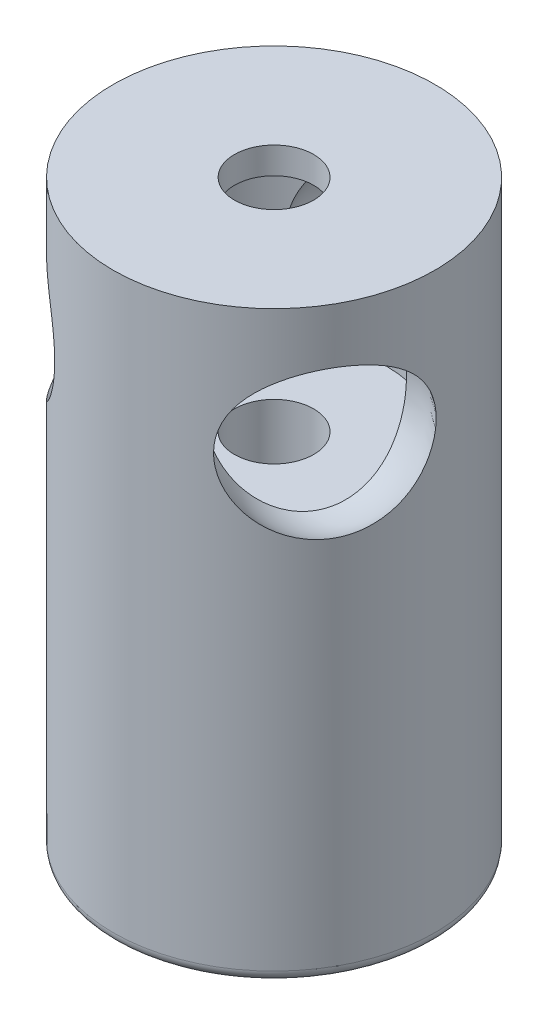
ISO-10303-21;
HEADER;
FILE_DESCRIPTION(('STEP AP214'),'2;1');
FILE_NAME('part.step','',(''),(''),'','','');
FILE_SCHEMA(('AUTOMOTIVE_DESIGN { 1 0 10303 214 1 1 1 1 }'));
ENDSEC;
DATA;
#1=APPLICATION_CONTEXT('core data for automotive mechanical design processes');
#2=APPLICATION_PROTOCOL_DEFINITION('international standard','automotive_design',2000,#1);
#3=PRODUCT_CONTEXT('',#1,'mechanical');
#4=PRODUCT('Part','Part','',(#3));
#5=PRODUCT_RELATED_PRODUCT_CATEGORY('part','',(#4));
#6=PRODUCT_DEFINITION_FORMATION('','',#4);
#7=PRODUCT_DEFINITION_CONTEXT('part definition',#1,'design');
#8=PRODUCT_DEFINITION('design','',#6,#7);
#9=PRODUCT_DEFINITION_SHAPE('','',#8);
#10=(LENGTH_UNIT() NAMED_UNIT(*) SI_UNIT(.MILLI.,.METRE.));
#11=(NAMED_UNIT(*) PLANE_ANGLE_UNIT() SI_UNIT($,.RADIAN.));
#12=(NAMED_UNIT(*) SI_UNIT($,.STERADIAN.) SOLID_ANGLE_UNIT());
#13=UNCERTAINTY_MEASURE_WITH_UNIT(LENGTH_MEASURE(1.E-05),#10,'distance_accuracy_value','');
#14=(GEOMETRIC_REPRESENTATION_CONTEXT(3) GLOBAL_UNCERTAINTY_ASSIGNED_CONTEXT((#13)) GLOBAL_UNIT_ASSIGNED_CONTEXT((#10,
#11,#12)) REPRESENTATION_CONTEXT('',''));
#15=CARTESIAN_POINT('',(0.,0.,0.));
#16=DIRECTION('',(0.,0.,1.));
#17=DIRECTION('',(1.,0.,0.));
#18=AXIS2_PLACEMENT_3D('',#15,#16,#17);
#19=CARTESIAN_POINT('',(0.,12.6227286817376,0.));
#20=DIRECTION('',(0.,1.,0.));
#21=DIRECTION('',(0.,0.,1.));
#22=AXIS2_PLACEMENT_3D('',#19,#20,#21);
#23=CYLINDRICAL_SURFACE('',#22,1.99058744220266);
#24=CARTESIAN_POINT('',(0.,4.34418892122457,0.));
#25=DIRECTION('',(0.,1.,0.));
#26=DIRECTION('',(0.,0.,1.));
#27=AXIS2_PLACEMENT_3D('',#24,#25,#26);
#28=CIRCLE('',#27,1.99058744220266);
#29=CARTESIAN_POINT('',(0.,4.34418892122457,1.99058744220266));
#30=VERTEX_POINT('',#29);
#31=EDGE_CURVE('E10',#30,#30,#28,.T.);
#32=ORIENTED_EDGE('',*,*,#31,.F.);
#33=EDGE_LOOP('',(#32));
#34=FACE_BOUND('',#33,.T.);
#35=CARTESIAN_POINT('',(0.,6.40873465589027,0.));
#36=DIRECTION('',(0.,1.,0.));
#37=DIRECTION('',(0.,0.,1.));
#38=AXIS2_PLACEMENT_3D('',#35,#36,#37);
#39=CIRCLE('',#38,1.99058744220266);
#40=CARTESIAN_POINT('',(0.,6.40873465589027,1.99058744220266));
#41=VERTEX_POINT('',#40);
#42=EDGE_CURVE('E57',#41,#41,#39,.T.);
#43=ORIENTED_EDGE('',*,*,#42,.T.);
#44=EDGE_LOOP('',(#43));
#45=FACE_BOUND('',#44,.T.);
#46=ADVANCED_FACE('F34',(#34,#45),#23,.F.);
#47=CARTESIAN_POINT('',(0.,4.34418892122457,0.));
#48=DIRECTION('',(0.,1.,0.));
#49=DIRECTION('',(0.,0.,1.));
#50=AXIS2_PLACEMENT_3D('',#47,#48,#49);
#51=TOROIDAL_SURFACE('',#50,2.156279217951,0.165691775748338);
#52=CARTESIAN_POINT('',(0.,4.34418892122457,0.));
#53=DIRECTION('',(0.,1.,0.));
#54=DIRECTION('',(0.,0.,1.));
#55=AXIS2_PLACEMENT_3D('',#52,#53,#54);
#56=CIRCLE('',#55,2.32197099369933);
#57=CARTESIAN_POINT('',(0.,4.34418892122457,2.32197099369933));
#58=VERTEX_POINT('',#57);
#59=EDGE_CURVE('E41',#58,#58,#56,.T.);
#60=ORIENTED_EDGE('',*,*,#59,.F.);
#61=EDGE_LOOP('',(#60));
#62=FACE_BOUND('',#61,.T.);
#63=ORIENTED_EDGE('',*,*,#31,.T.);
#64=EDGE_LOOP('',(#63));
#65=FACE_BOUND('',#64,.T.);
#66=ADVANCED_FACE('F130',(#62,#65),#51,.T.);
#67=CARTESIAN_POINT('',(0.,12.6227286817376,0.));
#68=DIRECTION('',(0.,1.,0.));
#69=DIRECTION('',(0.,0.,1.));
#70=AXIS2_PLACEMENT_3D('',#67,#68,#69);
#71=CYLINDRICAL_SURFACE('',#70,2.32197099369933);
#72=CARTESIAN_POINT('',(-2.32190491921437,10.7621571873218,-0.0175168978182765));
#73=CARTESIAN_POINT('',(-2.32190697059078,10.816123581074,-0.0175121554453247));
#74=CARTESIAN_POINT('',(-2.32195797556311,10.8701430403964,-0.0126107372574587));
#75=CARTESIAN_POINT('',(-2.32198024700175,10.9764967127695,0.00669888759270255));
#76=CARTESIAN_POINT('',(-2.3219513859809,11.0288280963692,0.0211222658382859));
#77=CARTESIAN_POINT('',(-2.32130743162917,11.1300520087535,0.0585318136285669));
#78=CARTESIAN_POINT('',(-2.32069484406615,11.1789582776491,0.0814811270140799));
#79=CARTESIAN_POINT('',(-2.31820957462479,11.2724916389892,0.134766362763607));
#80=CARTESIAN_POINT('',(-2.31633689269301,11.3171187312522,0.165102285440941));
#81=CARTESIAN_POINT('',(-2.31045963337,11.4035541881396,0.233587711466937));
#82=CARTESIAN_POINT('',(-2.30635044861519,11.4450998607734,0.272058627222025));
#83=CARTESIAN_POINT('',(-2.29516489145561,11.5221614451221,0.35424302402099));
#84=CARTESIAN_POINT('',(-2.28808740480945,11.5576750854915,0.397958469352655));
#85=CARTESIAN_POINT('',(-2.26929108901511,11.6261169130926,0.494524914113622));
#86=CARTESIAN_POINT('',(-2.2571272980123,11.658260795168,0.547846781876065));
#87=CARTESIAN_POINT('',(-2.22770527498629,11.7143233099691,0.65733950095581));
#88=CARTESIAN_POINT('',(-2.21044526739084,11.7382390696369,0.713511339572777));
#89=CARTESIAN_POINT('',(-2.1694239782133,11.778781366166,0.830170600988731));
#90=CARTESIAN_POINT('',(-2.14534625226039,11.7949103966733,0.890720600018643));
#91=CARTESIAN_POINT('',(-2.09135461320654,11.8176034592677,1.01100571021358));
#92=CARTESIAN_POINT('',(-2.06144036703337,11.8241669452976,1.07074077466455));
#93=CARTESIAN_POINT('',(-1.99617304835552,11.8276840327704,1.18801347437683));
#94=CARTESIAN_POINT('',(-1.96078327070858,11.8245698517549,1.24553274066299));
#95=CARTESIAN_POINT('',(-1.88582899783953,11.808610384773,1.35634566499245));
#96=CARTESIAN_POINT('',(-1.84626440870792,11.795764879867,1.40963922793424));
#97=CARTESIAN_POINT('',(-1.7645213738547,11.7604663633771,1.51070719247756));
#98=CARTESIAN_POINT('',(-1.72234436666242,11.73801859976,1.55848459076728));
#99=CARTESIAN_POINT('',(-1.63726647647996,11.6837109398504,1.6476364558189));
#100=CARTESIAN_POINT('',(-1.59436549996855,11.6518498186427,1.68901008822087));
#101=CARTESIAN_POINT('',(-1.51017210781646,11.5790825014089,1.76468987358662));
#102=CARTESIAN_POINT('',(-1.46887729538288,11.5381904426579,1.79900691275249));
#103=CARTESIAN_POINT('',(-1.39039680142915,11.4478240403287,1.86033029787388));
#104=CARTESIAN_POINT('',(-1.35321073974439,11.3983504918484,1.8873373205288));
#105=CARTESIAN_POINT('',(-1.28743723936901,11.2943280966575,1.93276461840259));
#106=CARTESIAN_POINT('',(-1.25851773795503,11.2401467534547,1.95154081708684));
#107=CARTESIAN_POINT('',(-1.209462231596,11.1261765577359,1.98232141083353));
#108=CARTESIAN_POINT('',(-1.18931555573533,11.0663946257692,1.99433403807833));
#109=CARTESIAN_POINT('',(-1.16163053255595,10.9507337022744,2.01056965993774));
#110=CARTESIAN_POINT('',(-1.15286279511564,10.8952560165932,2.01555853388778));
#111=CARTESIAN_POINT('',(-1.14448346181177,10.7834010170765,2.02033013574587));
#112=CARTESIAN_POINT('',(-1.14486641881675,10.7270242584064,2.02011596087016));
#113=CARTESIAN_POINT('',(-1.15427235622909,10.6205828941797,2.01475200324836));
#114=CARTESIAN_POINT('',(-1.16248616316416,10.5704199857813,2.010064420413));
#115=CARTESIAN_POINT('',(-1.18577141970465,10.4723282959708,1.99641576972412));
#116=CARTESIAN_POINT('',(-1.2008434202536,10.4243996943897,1.98745435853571));
#117=CARTESIAN_POINT('',(-1.23731691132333,10.3306310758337,1.96495902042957));
#118=CARTESIAN_POINT('',(-1.25887656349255,10.2848809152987,1.95130946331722));
#119=CARTESIAN_POINT('',(-1.30685121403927,10.197706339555,1.91950933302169));
#120=CARTESIAN_POINT('',(-1.33326800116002,10.1562835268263,1.90135710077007));
#121=CARTESIAN_POINT('',(-1.39273261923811,10.0739890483,1.85831467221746));
#122=CARTESIAN_POINT('',(-1.42619096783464,10.0336883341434,1.83290038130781));
#123=CARTESIAN_POINT('',(-1.49565974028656,9.95958005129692,1.77666823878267));
#124=CARTESIAN_POINT('',(-1.53167136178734,9.92577555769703,1.7458478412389));
#125=CARTESIAN_POINT('',(-1.60851343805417,9.86172228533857,1.6754769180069));
#126=CARTESIAN_POINT('',(-1.64944906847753,9.83223401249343,1.63534652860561));
#127=CARTESIAN_POINT('',(-1.73052206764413,9.78183948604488,1.5493029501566));
#128=CARTESIAN_POINT('',(-1.77065923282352,9.7609353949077,1.50338830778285));
#129=CARTESIAN_POINT('',(-1.85023643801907,9.72713867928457,1.40441483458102));
#130=CARTESIAN_POINT('',(-1.88956429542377,9.71464783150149,1.35112781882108));
#131=CARTESIAN_POINT('',(-1.96403016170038,9.69933966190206,1.24039816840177));
#132=CARTESIAN_POINT('',(-1.99916797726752,9.69652278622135,1.18295534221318));
#133=CARTESIAN_POINT('',(-2.06425208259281,9.70059229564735,1.0653361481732));
#134=CARTESIAN_POINT('',(-2.09418495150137,9.70750335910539,1.00515320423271));
#135=CARTESIAN_POINT('',(-2.14812472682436,9.73101228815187,0.884028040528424));
#136=CARTESIAN_POINT('',(-2.17213146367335,9.74761043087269,0.823085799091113));
#137=CARTESIAN_POINT('',(-2.21409452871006,9.79035960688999,0.70243664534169));
#138=CARTESIAN_POINT('',(-2.23204730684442,9.81651622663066,0.642730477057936));
#139=CARTESIAN_POINT('',(-2.26222546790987,9.87814995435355,0.52676061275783));
#140=CARTESIAN_POINT('',(-2.27445016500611,9.91362817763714,0.47049732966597));
#141=CARTESIAN_POINT('',(-2.2938869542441,9.99328664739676,0.36406436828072));
#142=CARTESIAN_POINT('',(-2.30112922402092,10.0374123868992,0.313859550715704));
#143=CARTESIAN_POINT('',(-2.31184455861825,10.1339122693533,0.221556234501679));
#144=CARTESIAN_POINT('',(-2.31531760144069,10.1862864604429,0.179457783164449));
#145=CARTESIAN_POINT('',(-2.31970446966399,10.2945868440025,0.108243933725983));
#146=CARTESIAN_POINT('',(-2.32076742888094,10.3500732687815,0.078471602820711));
#147=CARTESIAN_POINT('',(-2.32190132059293,10.4657019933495,0.0302665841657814));
#148=CARTESIAN_POINT('',(-2.32197516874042,10.5258300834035,0.0118007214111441));
#149=CARTESIAN_POINT('',(-2.32196899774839,10.6159398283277,-0.00602551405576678));
#150=CARTESIAN_POINT('',(-2.32194978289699,10.6450097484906,-0.0103247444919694));
#151=CARTESIAN_POINT('',(-2.32191718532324,10.7034335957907,-0.0160717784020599));
#152=CARTESIAN_POINT('',(-2.3219038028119,10.7327875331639,-0.0175194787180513));
#153=CARTESIAN_POINT('',(-2.32190491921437,10.7621571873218,-0.0175168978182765));
#154=B_SPLINE_CURVE_WITH_KNOTS('',3,(#72,#73,#74,#75,#76,#77,#78,#79,#80,#81,#82,#83,#84,#85,
#86,#87,#88,#89,#90,#91,#92,#93,#94,#95,#96,#97,#98,#99,#100,#101,#102,#103,#104,#105,#106,#107,
#108,#109,#110,#111,#112,#113,#114,#115,#116,#117,#118,#119,#120,#121,#122,#123,#124,#125,#126,
#127,#128,#129,#130,#131,#132,#133,#134,#135,#136,#137,#138,#139,#140,#141,#142,#143,#144,#145,
#146,#147,#148,#149,#150,#151,#152,#153),.UNSPECIFIED.,.T.,.F.,(4,2,2,2,2,2,2,2,2,2,2,2,2,2,2,2,
2,2,2,2,2,2,2,2,2,2,2,2,2,2,2,2,2,2,2,2,2,2,2,2,4),(0.,0.16177619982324,0.323810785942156,
0.48515292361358,0.646495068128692,0.816128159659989,0.98582498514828,1.17530867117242,
1.36485845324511,1.56529421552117,1.76574141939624,1.96759571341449,2.16945454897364,
2.37120320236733,2.57297811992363,2.77443938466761,2.97588199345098,3.16745334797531,
3.35879102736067,3.52700776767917,3.6951243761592,3.84756099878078,4.00000986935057,
4.15652661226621,4.31310111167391,4.48704580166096,4.66107262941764,4.85360746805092,
5.0461907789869,5.24741950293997,5.44865750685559,5.65040694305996,5.85216215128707,
6.05403546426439,6.2559329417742,6.45659653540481,6.65726130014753,6.84512435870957,
7.03243352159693,7.12047237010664,7.20851440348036),.UNSPECIFIED.);
#155=CARTESIAN_POINT('',(-2.32190491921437,10.7621571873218,-0.0175168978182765));
#156=VERTEX_POINT('',#155);
#157=EDGE_CURVE('E58',#156,#156,#154,.T.);
#158=ORIENTED_EDGE('',*,*,#157,.T.);
#159=EDGE_LOOP('',(#158));
#160=FACE_BOUND('',#159,.T.);
#161=CARTESIAN_POINT('',(1.14578238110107,10.7621571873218,2.01958709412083));
#162=CARTESIAN_POINT('',(1.14578751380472,10.816123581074,2.01958649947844));
#163=CARTESIAN_POINT('',(1.15005776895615,10.8701430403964,2.01717996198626));
#164=CARTESIAN_POINT('',(1.16679153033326,10.9764967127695,2.00754443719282));
#165=CARTESIAN_POINT('',(1.1792681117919,11.0288280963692,2.0003077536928));
#166=CARTESIAN_POINT('',(1.21134375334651,11.1300520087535,1.98104529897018));
#167=CARTESIAN_POINT('',(1.23091214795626,11.1789582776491,1.9690401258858));
#168=CARTESIAN_POINT('',(1.27581588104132,11.2724916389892,1.94024520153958));
#169=CARTESIAN_POINT('',(1.30115121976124,11.3171187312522,1.92345545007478));
#170=CARTESIAN_POINT('',(1.35752270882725,11.4035541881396,1.88412288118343));
#171=CARTESIAN_POINT('',(1.3887849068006,11.4450998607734,1.86132876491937));
#172=CARTESIAN_POINT('',(1.45436590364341,11.5221614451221,1.81054958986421));
#173=CARTESIAN_POINT('',(1.4886858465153,11.5576750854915,1.78256258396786));
#174=CARTESIAN_POINT('',(1.56291668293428,11.6261169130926,1.71800127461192));
#175=CARTESIAN_POINT('',(1.60301287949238,11.658260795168,1.68080618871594));
#176=CARTESIAN_POINT('',(1.68312534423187,11.7143233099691,1.60057960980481));
#177=CARTESIAN_POINT('',(1.72314157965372,11.7382390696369,1.55754608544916));
#178=CARTESIAN_POINT('',(1.80366081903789,11.778781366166,1.46369097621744));
#179=CARTESIAN_POINT('',(1.84405979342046,11.7949103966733,1.4125640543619));
#180=CARTESIAN_POINT('',(1.92123393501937,11.8176034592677,1.30566336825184));
#181=CARTESIAN_POINT('',(1.95800889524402,11.8241669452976,1.24988933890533));
#182=CARTESIAN_POINT('',(2.02693637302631,11.8276840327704,1.13472983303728));
#183=CARTESIAN_POINT('',(2.0590546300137,11.8245698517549,1.07532175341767));
#184=CARTESIAN_POINT('',(2.11754430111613,11.808610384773,0.955002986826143));
#185=CARTESIAN_POINT('',(2.1439155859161,11.795764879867,0.89409226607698));
#186=CARTESIAN_POINT('',(2.19057149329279,11.7604663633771,0.772766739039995));
#187=CARTESIAN_POINT('',(2.21085943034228,11.73801859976,0.712351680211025));
#188=CARTESIAN_POINT('',(2.24552826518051,11.6837109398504,0.594096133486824));
#189=CARTESIAN_POINT('',(2.25990839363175,11.6518498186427,0.536255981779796));
#190=CARTESIAN_POINT('',(2.2833523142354,11.5790825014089,0.425502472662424));
#191=CARTESIAN_POINT('',(2.29242433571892,11.5381904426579,0.372581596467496));
#192=CARTESIAN_POINT('',(2.30629169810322,11.4478240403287,0.273953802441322));
#193=CARTESIAN_POINT('',(2.31108743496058,11.3983504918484,0.228246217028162));
#194=CARTESIAN_POINT('',(2.31754187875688,11.2943280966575,0.148571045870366));
#195=CARTESIAN_POINT('',(2.31934279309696,11.2401467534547,0.114137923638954));
#196=CARTESIAN_POINT('',(2.32147181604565,11.1261765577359,0.0562643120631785));
#197=CARTESIAN_POINT('',(2.3218017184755,11.0663946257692,0.0328104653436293));
#198=CARTESIAN_POINT('',(2.3220196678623,10.9507337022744,0.000716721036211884));
#199=CARTESIAN_POINT('',(2.32195629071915,10.8952560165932,-0.00937079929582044));
#200=CARTESIAN_POINT('',(2.32189895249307,10.7834010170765,-0.0190133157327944));
#201=CARTESIAN_POINT('',(2.32190495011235,10.7270242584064,-0.0185745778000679));
#202=CARTESIAN_POINT('',(2.32196259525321,10.6205828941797,-0.00774681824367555));
#203=CARTESIAN_POINT('',(2.32200993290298,10.5704199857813,0.00171033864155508));
#204=CARTESIAN_POINT('',(2.32183248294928,10.4723282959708,0.0287002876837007));
#205=CARTESIAN_POINT('',(2.32160767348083,10.4243996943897,0.0462337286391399));
#206=CARTESIAN_POINT('',(2.32036288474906,10.3306310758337,0.0890683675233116));
#207=CARTESIAN_POINT('',(2.31932184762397,10.2848809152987,0.114564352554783));
#208=CARTESIAN_POINT('',(2.31576945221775,10.197706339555,0.172011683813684));
#209=CARTESIAN_POINT('',(2.31325755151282,10.1562835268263,0.203965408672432));
#210=CARTESIAN_POINT('',(2.30571402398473,10.0739890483,0.276984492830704));
#211=CARTESIAN_POINT('',(2.30043377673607,10.0336883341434,0.318667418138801));
#212=CARTESIAN_POINT('',(2.28646969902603,9.95958005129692,0.406945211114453));
#213=CARTESIAN_POINT('',(2.27778426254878,9.92577555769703,0.45354238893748));
#214=CARTESIAN_POINT('',(2.25526229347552,9.86172228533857,0.555275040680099));
#215=CARTESIAN_POINT('',(2.24097617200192,9.83223401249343,0.610791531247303));
#216=CARTESIAN_POINT('',(2.20699674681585,9.78183948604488,0.72402459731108));
#217=CARTESIAN_POINT('',(2.18730208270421,9.7609353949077,0.781741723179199));
#218=CARTESIAN_POINT('',(2.14137714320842,9.72713867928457,0.900144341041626));
#219=CARTESIAN_POINT('',(2.1148931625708,9.71464783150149,0.960846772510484));
#220=CARTESIAN_POINT('',(2.05623140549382,9.69933966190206,1.08070092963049));
#221=CARTESIAN_POINT('',(2.02405336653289,9.69652278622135,1.13985258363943));
#222=CARTESIAN_POINT('',(1.95473420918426,9.70059229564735,1.2550266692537));
#223=CARTESIAN_POINT('',(1.91758068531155,9.70750335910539,1.31104076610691));
#224=CARTESIAN_POINT('',(1.83965310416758,9.73101228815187,1.41831656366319));
#225=CARTESIAN_POINT('',(1.7988789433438,9.74761043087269,1.46957812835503));
#226=CARTESIAN_POINT('',(1.71537524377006,9.79035960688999,1.56624378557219));
#227=CARTESIAN_POINT('',(1.67264457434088,9.81651622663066,1.61164443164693));
#228=CARTESIAN_POINT('',(1.58730080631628,9.87814995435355,1.69576441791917));
#229=CARTESIAN_POINT('',(1.54468772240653,9.91362817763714,1.734482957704));
#230=CARTESIAN_POINT('',(1.4622324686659,9.99328664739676,1.80453219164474));
#231=CARTESIAN_POINT('',(1.42237495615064,10.0374123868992,1.83590659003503));
#232=CARTESIAN_POINT('',(1.34779560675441,10.1339122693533,1.89133800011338));
#233=CARTESIAN_POINT('',(1.31307379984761,10.1862864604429,1.91539496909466));
#234=CARTESIAN_POINT('',(1.25359423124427,10.2945868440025,1.95480103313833));
#235=CARTESIAN_POINT('',(1.2283421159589,10.3500732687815,1.97060774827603));
#236=CARTESIAN_POINT('',(1.18716229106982,10.4657019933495,1.99569223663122));
#237=CARTESIAN_POINT('',(1.17120730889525,10.5258300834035,2.00498912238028));
#238=CARTESIAN_POINT('',(1.15576625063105,10.6159398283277,2.01389689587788));
#239=CARTESIAN_POINT('',(1.15203340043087,10.6450097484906,2.01602987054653));
#240=CARTESIAN_POINT('',(1.14704002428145,10.7034335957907,2.01887515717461));
#241=CARTESIAN_POINT('',(1.14577958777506,10.7327875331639,2.01958741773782));
#242=CARTESIAN_POINT('',(1.14578238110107,10.7621571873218,2.01958709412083));
#243=B_SPLINE_CURVE_WITH_KNOTS('',3,(#161,#162,#163,#164,#165,#166,#167,#168,#169,#170,#171,
#172,#173,#174,#175,#176,#177,#178,#179,#180,#181,#182,#183,#184,#185,#186,#187,#188,#189,#190,
#191,#192,#193,#194,#195,#196,#197,#198,#199,#200,#201,#202,#203,#204,#205,#206,#207,#208,#209,
#210,#211,#212,#213,#214,#215,#216,#217,#218,#219,#220,#221,#222,#223,#224,#225,#226,#227,#228,
#229,#230,#231,#232,#233,#234,#235,#236,#237,#238,#239,#240,#241,#242),.UNSPECIFIED.,.T.,.F.,(4,
2,2,2,2,2,2,2,2,2,2,2,2,2,2,2,2,2,2,2,2,2,2,2,2,2,2,2,2,2,2,2,2,2,2,2,2,2,2,2,4),(0.,
0.16177619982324,0.323810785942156,0.485152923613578,0.646495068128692,0.816128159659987,
0.98582498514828,1.17530867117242,1.36485845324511,1.56529421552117,1.76574141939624,
1.96759571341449,2.16945454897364,2.37120320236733,2.57297811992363,2.77443938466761,
2.97588199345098,3.16745334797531,3.35879102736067,3.52700776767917,3.6951243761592,
3.84756099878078,4.00000986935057,4.15652661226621,4.31310111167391,4.48704580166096,
4.66107262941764,4.85360746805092,5.0461907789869,5.24741950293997,5.44865750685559,
5.65040694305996,5.85216215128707,6.05403546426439,6.2559329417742,6.45659653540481,
6.65726130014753,6.84512435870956,7.03243352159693,7.12047237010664,7.20851440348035),.UNSPECIFIED.);
#244=CARTESIAN_POINT('',(1.14578238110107,10.7621571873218,2.01958709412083));
#245=VERTEX_POINT('',#244);
#246=EDGE_CURVE('E87',#245,#245,#243,.T.);
#247=ORIENTED_EDGE('',*,*,#246,.T.);
#248=EDGE_LOOP('',(#247));
#249=FACE_BOUND('',#248,.T.);
#250=CARTESIAN_POINT('',(1.17612253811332,10.7621571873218,-2.00207019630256));
#251=CARTESIAN_POINT('',(1.17611945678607,10.816123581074,-2.00207434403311));
#252=CARTESIAN_POINT('',(1.17190020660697,10.8701430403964,-2.00456922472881));
#253=CARTESIAN_POINT('',(1.15518871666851,10.9764967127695,-2.01424332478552));
#254=CARTESIAN_POINT('',(1.14268327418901,11.0288280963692,-2.02143001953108));
#255=CARTESIAN_POINT('',(1.10996367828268,11.1300520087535,-2.03957711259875));
#256=CARTESIAN_POINT('',(1.0897826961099,11.1789582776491,-2.05052125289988));
#257=CARTESIAN_POINT('',(1.04239369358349,11.2724916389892,-2.07501156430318));
#258=CARTESIAN_POINT('',(1.01518567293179,11.3171187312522,-2.08855773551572));
#259=CARTESIAN_POINT('',(0.952936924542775,11.4035541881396,-2.11771059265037));
#260=CARTESIAN_POINT('',(0.91756554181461,11.4450998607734,-2.1333873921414));
#261=CARTESIAN_POINT('',(0.840798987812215,11.5221614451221,-2.1647926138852));
#262=CARTESIAN_POINT('',(0.799401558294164,11.5576750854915,-2.18052105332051));
#263=CARTESIAN_POINT('',(0.706374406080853,11.6261169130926,-2.21252618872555));
#264=CARTESIAN_POINT('',(0.654114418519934,11.658260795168,-2.22865297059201));
#265=CARTESIAN_POINT('',(0.544579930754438,11.7143233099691,-2.25791911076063));
#266=CARTESIAN_POINT('',(0.487303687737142,11.7382390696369,-2.27105742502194));
#267=CARTESIAN_POINT('',(0.365763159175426,11.778781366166,-2.29386157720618));
#268=CARTESIAN_POINT('',(0.301286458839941,11.7949103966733,-2.30328465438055));
#269=CARTESIAN_POINT('',(0.17012067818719,11.8176034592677,-2.31666907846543));
#270=CARTESIAN_POINT('',(0.103431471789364,11.8241669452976,-2.32063011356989));
#271=CARTESIAN_POINT('',(-0.0307633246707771,11.8276840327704,-2.32274330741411));
#272=CARTESIAN_POINT('',(-0.0982713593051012,11.8245698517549,-2.32085449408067));
#273=CARTESIAN_POINT('',(-0.231715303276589,11.808610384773,-2.31134865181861));
#274=CARTESIAN_POINT('',(-0.297651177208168,11.795764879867,-2.30373149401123));
#275=CARTESIAN_POINT('',(-0.426050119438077,11.7604663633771,-2.28347393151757));
#276=CARTESIAN_POINT('',(-0.488515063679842,11.73801859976,-2.27083627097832));
#277=CARTESIAN_POINT('',(-0.608261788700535,11.6837109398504,-2.24173258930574));
#278=CARTESIAN_POINT('',(-0.665542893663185,11.6518498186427,-2.22526607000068));
#279=CARTESIAN_POINT('',(-0.773180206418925,11.5790825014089,-2.19019234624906));
#280=CARTESIAN_POINT('',(-0.823547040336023,11.5381904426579,-2.17158850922));
#281=CARTESIAN_POINT('',(-0.915894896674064,11.4478240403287,-2.13428410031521));
#282=CARTESIAN_POINT('',(-0.957876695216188,11.3983504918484,-2.11558353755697));
#283=CARTESIAN_POINT('',(-1.03010463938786,11.2943280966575,-2.08133566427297));
#284=CARTESIAN_POINT('',(-1.06082505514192,11.2401467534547,-2.06567874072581));
#285=CARTESIAN_POINT('',(-1.11200958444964,11.1261765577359,-2.03858572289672));
#286=CARTESIAN_POINT('',(-1.13248616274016,11.0663946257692,-2.02714450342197));
#287=CARTESIAN_POINT('',(-1.16038913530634,10.9507337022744,-2.01128638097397));
#288=CARTESIAN_POINT('',(-1.1690934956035,10.8952560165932,-2.00618773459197));
#289=CARTESIAN_POINT('',(-1.17741549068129,10.7834010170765,-2.00131682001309));
#290=CARTESIAN_POINT('',(-1.17703853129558,10.7270242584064,-2.00154138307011));
#291=CARTESIAN_POINT('',(-1.16769023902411,10.6205828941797,-2.0070051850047));
#292=CARTESIAN_POINT('',(-1.15952376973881,10.5704199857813,-2.01177475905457));
#293=CARTESIAN_POINT('',(-1.13606106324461,10.4723282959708,-2.02511605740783));
#294=CARTESIAN_POINT('',(-1.12076425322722,10.4243996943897,-2.03368808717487));
#295=CARTESIAN_POINT('',(-1.08304597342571,10.3306310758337,-2.05402738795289));
#296=CARTESIAN_POINT('',(-1.06044528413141,10.2848809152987,-2.06587381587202));
#297=CARTESIAN_POINT('',(-1.00891823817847,10.197706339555,-2.09152101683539));
#298=CARTESIAN_POINT('',(-0.979989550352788,10.1562835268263,-2.10532250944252));
#299=CARTESIAN_POINT('',(-0.912981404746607,10.0739890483,-2.13529916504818));
#300=CARTESIAN_POINT('',(-0.874242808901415,10.0336883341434,-2.15156779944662));
#301=CARTESIAN_POINT('',(-0.790809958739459,9.95958005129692,-2.18361344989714));
#302=CARTESIAN_POINT('',(-0.74611290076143,9.92577555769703,-2.19939023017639));
#303=CARTESIAN_POINT('',(-0.646748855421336,9.86172228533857,-2.23075195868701));
#304=CARTESIAN_POINT('',(-0.591527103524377,9.83223401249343,-2.24613805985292));
#305=CARTESIAN_POINT('',(-0.476474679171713,9.78183948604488,-2.27332754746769));
#306=CARTESIAN_POINT('',(-0.416642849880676,9.7609353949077,-2.28513003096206));
#307=CARTESIAN_POINT('',(-0.291140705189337,9.72713867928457,-2.30455917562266));
#308=CARTESIAN_POINT('',(-0.225328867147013,9.71464783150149,-2.31197459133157));
#309=CARTESIAN_POINT('',(-0.0922012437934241,9.69933966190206,-2.32109909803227));
#310=CARTESIAN_POINT('',(-0.0248853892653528,9.69652278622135,-2.32280792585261));
#311=CARTESIAN_POINT('',(0.109517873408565,9.70059229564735,-2.32036281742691));
#312=CARTESIAN_POINT('',(0.176604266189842,9.70750335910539,-2.31619397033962));
#313=CARTESIAN_POINT('',(0.308471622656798,9.73101228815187,-2.30234460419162));
#314=CARTESIAN_POINT('',(0.373252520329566,9.74761043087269,-2.29266392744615));
#315=CARTESIAN_POINT('',(0.498719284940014,9.79035960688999,-2.26868043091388));
#316=CARTESIAN_POINT('',(0.559402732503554,9.81651622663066,-2.25437490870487));
#317=CARTESIAN_POINT('',(0.674924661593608,9.87814995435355,-2.222525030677));
#318=CARTESIAN_POINT('',(0.729762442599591,9.91362817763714,-2.20498028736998));
#319=CARTESIAN_POINT('',(0.831654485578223,9.99328664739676,-2.16859655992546));
#320=CARTESIAN_POINT('',(0.878754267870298,10.0374123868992,-2.14976614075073));
#321=CARTESIAN_POINT('',(0.964048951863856,10.1339122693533,-2.11289423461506));
#322=CARTESIAN_POINT('',(1.0022438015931,10.1862864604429,-2.09485275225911));
#323=CARTESIAN_POINT('',(1.06611023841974,10.2945868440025,-2.06304496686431));
#324=CARTESIAN_POINT('',(1.09242531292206,10.3500732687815,-2.04907935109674));
#325=CARTESIAN_POINT('',(1.13473902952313,10.4657019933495,-2.025958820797));
#326=CARTESIAN_POINT('',(1.15076785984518,10.5258300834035,-2.01678984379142));
#327=CARTESIAN_POINT('',(1.16620274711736,10.6159398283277,-2.00787138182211));
#328=CARTESIAN_POINT('',(1.16991638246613,10.6450097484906,-2.00570512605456));
#329=CARTESIAN_POINT('',(1.17487716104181,10.7034335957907,-2.00280337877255));
#330=CARTESIAN_POINT('',(1.17612421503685,10.7327875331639,-2.00206793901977));
#331=CARTESIAN_POINT('',(1.17612253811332,10.7621571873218,-2.00207019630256));
#332=B_SPLINE_CURVE_WITH_KNOTS('',3,(#250,#251,#252,#253,#254,#255,#256,#257,#258,#259,#260,
#261,#262,#263,#264,#265,#266,#267,#268,#269,#270,#271,#272,#273,#274,#275,#276,#277,#278,#279,
#280,#281,#282,#283,#284,#285,#286,#287,#288,#289,#290,#291,#292,#293,#294,#295,#296,#297,#298,
#299,#300,#301,#302,#303,#304,#305,#306,#307,#308,#309,#310,#311,#312,#313,#314,#315,#316,#317,
#318,#319,#320,#321,#322,#323,#324,#325,#326,#327,#328,#329,#330,#331),.UNSPECIFIED.,.T.,.F.,(4,
2,2,2,2,2,2,2,2,2,2,2,2,2,2,2,2,2,2,2,2,2,2,2,2,2,2,2,2,2,2,2,2,2,2,2,2,2,2,2,4),(0.,
0.16177619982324,0.323810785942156,0.48515292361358,0.646495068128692,0.816128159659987,
0.985824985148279,1.17530867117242,1.36485845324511,1.56529421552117,1.76574141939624,
1.96759571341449,2.16945454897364,2.37120320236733,2.57297811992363,2.77443938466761,
2.97588199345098,3.16745334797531,3.35879102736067,3.52700776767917,3.6951243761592,
3.84756099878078,4.00000986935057,4.15652661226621,4.31310111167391,4.48704580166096,
4.66107262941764,4.85360746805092,5.0461907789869,5.24741950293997,5.44865750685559,
5.65040694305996,5.85216215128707,6.05403546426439,6.2559329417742,6.4565965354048,
6.65726130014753,6.84512435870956,7.03243352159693,7.12047237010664,7.20851440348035),.UNSPECIFIED.);
#333=CARTESIAN_POINT('',(1.17612253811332,10.7621571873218,-2.00207019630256));
#334=VERTEX_POINT('',#333);
#335=EDGE_CURVE('E50',#334,#334,#332,.T.);
#336=ORIENTED_EDGE('',*,*,#335,.T.);
#337=EDGE_LOOP('',(#336));
#338=FACE_BOUND('',#337,.T.);
#339=CARTESIAN_POINT('',(0.,12.6227286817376,0.));
#340=DIRECTION('',(0.,1.,0.));
#341=DIRECTION('',(0.,0.,1.));
#342=AXIS2_PLACEMENT_3D('',#339,#340,#341);
#343=CIRCLE('',#342,2.32197099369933);
#344=CARTESIAN_POINT('',(0.,12.6227286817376,2.32197099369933));
#345=VERTEX_POINT('',#344);
#346=EDGE_CURVE('E46',#345,#345,#343,.T.);
#347=ORIENTED_EDGE('',*,*,#346,.F.);
#348=EDGE_LOOP('',(#347));
#349=FACE_BOUND('',#348,.T.);
#350=ORIENTED_EDGE('',*,*,#59,.T.);
#351=EDGE_LOOP('',(#350));
#352=FACE_BOUND('',#351,.T.);
#353=ADVANCED_FACE('F65',(#160,#249,#338,#349,#352),#71,.T.);
#354=CARTESIAN_POINT('',(0.,12.6227286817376,0.));
#355=DIRECTION('',(0.,-1.,0.));
#356=DIRECTION('',(0.,0.,-1.));
#357=AXIS2_PLACEMENT_3D('',#354,#355,#356);
#358=PLANE('',#357);
#359=CARTESIAN_POINT('',(0.,12.6227286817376,0.));
#360=DIRECTION('',(0.,-1.,0.));
#361=DIRECTION('',(0.,0.,-1.));
#362=AXIS2_PLACEMENT_3D('',#359,#360,#361);
#363=CIRCLE('',#362,0.5715);
#364=CARTESIAN_POINT('',(0.,12.6227286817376,-0.5715));
#365=VERTEX_POINT('',#364);
#366=EDGE_CURVE('E154',#365,#365,#363,.T.);
#367=ORIENTED_EDGE('',*,*,#366,.T.);
#368=EDGE_LOOP('',(#367));
#369=FACE_BOUND('',#368,.T.);
#370=ORIENTED_EDGE('',*,*,#346,.T.);
#371=EDGE_LOOP('',(#370));
#372=FACE_BOUND('',#371,.T.);
#373=ADVANCED_FACE('F126',(#369,#372),#358,.F.);
#374=CARTESIAN_POINT('',(0.,6.40873465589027,0.));
#375=DIRECTION('',(0.,1.,0.));
#376=DIRECTION('',(0.,0.,1.));
#377=AXIS2_PLACEMENT_3D('',#374,#375,#376);
#378=PLANE('',#377);
#379=CARTESIAN_POINT('',(0.,6.40873465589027,0.));
#380=DIRECTION('',(0.,1.,0.));
#381=DIRECTION('',(0.,0.,1.));
#382=AXIS2_PLACEMENT_3D('',#379,#380,#381);
#383=CIRCLE('',#382,0.5715);
#384=CARTESIAN_POINT('',(0.,6.40873465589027,0.5715));
#385=VERTEX_POINT('',#384);
#386=EDGE_CURVE('E152',#385,#385,#383,.T.);
#387=ORIENTED_EDGE('',*,*,#386,.T.);
#388=EDGE_LOOP('',(#387));
#389=FACE_BOUND('',#388,.T.);
#390=ORIENTED_EDGE('',*,*,#42,.F.);
#391=EDGE_LOOP('',(#390));
#392=FACE_BOUND('',#391,.T.);
#393=ADVANCED_FACE('F74',(#389,#392),#378,.F.);
#394=CARTESIAN_POINT('',(0.,10.7621571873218,-1.77025114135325));
#395=DIRECTION('',(0.,-1.,0.));
#396=DIRECTION('',(0.,0.,1.));
#397=AXIS2_PLACEMENT_3D('',#394,#395,#396);
#398=SPHERICAL_SURFACE('',#397,1.19875114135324);
#399=CARTESIAN_POINT('',(1.06919208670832,10.7621571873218,-1.22818787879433));
#400=CARTESIAN_POINT('',(1.06919074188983,10.8285730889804,-1.22819551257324));
#401=CARTESIAN_POINT('',(1.06489299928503,10.8951033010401,-1.2319721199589));
#402=CARTESIAN_POINT('',(1.04763457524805,11.0263382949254,-1.24667588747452));
#403=CARTESIAN_POINT('',(1.03465021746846,11.0910375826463,-1.25762258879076));
#404=CARTESIAN_POINT('',(0.999927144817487,11.2165688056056,-1.28539996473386));
#405=CARTESIAN_POINT('',(0.978206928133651,11.2774086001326,-1.30221819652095));
#406=CARTESIAN_POINT('',(0.925907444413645,11.3937629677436,-1.33990541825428));
#407=CARTESIAN_POINT('',(0.895331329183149,11.4492794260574,-1.36077296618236));
#408=CARTESIAN_POINT('',(0.824811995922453,11.5543524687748,-1.40465212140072));
#409=CARTESIAN_POINT('',(0.784743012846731,11.6038141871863,-1.42768976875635));
#410=CARTESIAN_POINT('',(0.695763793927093,11.6944454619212,-1.47309776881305));
#411=CARTESIAN_POINT('',(0.646855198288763,11.7356165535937,-1.49546824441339));
#412=CARTESIAN_POINT('',(0.543976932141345,11.8062702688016,-1.53576873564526));
#413=CARTESIAN_POINT('',(0.490436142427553,11.836272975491,-1.55387579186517));
#414=CARTESIAN_POINT('',(0.37761328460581,11.8865083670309,-1.58506653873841));
#415=CARTESIAN_POINT('',(0.318337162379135,11.9067510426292,-1.59815536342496));
#416=CARTESIAN_POINT('',(0.203571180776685,11.9347867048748,-1.61651964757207));
#417=CARTESIAN_POINT('',(0.148497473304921,11.9437943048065,-1.62255170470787));
#418=CARTESIAN_POINT('',(0.0373024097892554,11.9532708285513,-1.62890137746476));
#419=CARTESIAN_POINT('',(-0.0188183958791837,11.9537441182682,-1.62922191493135));
#420=CARTESIAN_POINT('',(-0.125828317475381,11.9464426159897,-1.62432447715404));
#421=CARTESIAN_POINT('',(-0.176783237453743,11.9393102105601,-1.61953784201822));
#422=CARTESIAN_POINT('',(-0.276557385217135,11.9180257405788,-1.60551270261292));
#423=CARTESIAN_POINT('',(-0.325376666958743,11.9038738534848,-1.59627431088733));
#424=CARTESIAN_POINT('',(-0.420426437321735,11.8687023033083,-1.57393815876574));
#425=CARTESIAN_POINT('',(-0.466604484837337,11.8475786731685,-1.56078228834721));
#426=CARTESIAN_POINT('',(-0.554608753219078,11.7991022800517,-1.53172353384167));
#427=CARTESIAN_POINT('',(-0.596433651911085,11.7717476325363,-1.51581981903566));
#428=CARTESIAN_POINT('',(-0.678684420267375,11.7086994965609,-1.48093805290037));
#429=CARTESIAN_POINT('',(-0.718639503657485,11.6724747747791,-1.46181199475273));
#430=CARTESIAN_POINT('',(-0.792205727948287,11.5941985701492,-1.42329033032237));
#431=CARTESIAN_POINT('',(-0.825813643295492,11.5521441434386,-1.40389459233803));
#432=CARTESIAN_POINT('',(-0.889972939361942,11.4579634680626,-1.36423873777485));
#433=CARTESIAN_POINT('',(-0.919738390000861,11.4052355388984,-1.34413238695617));
#434=CARTESIAN_POINT('',(-0.971161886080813,11.2948169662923,-1.30746428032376));
#435=CARTESIAN_POINT('',(-0.99281721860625,11.237124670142,-1.2909037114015));
#436=CARTESIAN_POINT('',(-1.02914189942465,11.1146460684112,-1.26216353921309));
#437=CARTESIAN_POINT('',(-1.04332983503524,11.0496422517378,-1.25029598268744));
#438=CARTESIAN_POINT('',(-1.06283104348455,10.9174290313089,-1.23376421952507));
#439=CARTESIAN_POINT('',(-1.06814583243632,10.8502200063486,-1.22909878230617));
#440=CARTESIAN_POINT('',(-1.06994225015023,10.7168320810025,-1.22753470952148));
#441=CARTESIAN_POINT('',(-1.06658436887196,10.65065694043,-1.2304949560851));
#442=CARTESIAN_POINT('',(-1.0513409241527,10.5200158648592,-1.24354247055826));
#443=CARTESIAN_POINT('',(-1.03945474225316,10.4555500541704,-1.25363025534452));
#444=CARTESIAN_POINT('',(-1.00712574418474,10.3303772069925,-1.27974241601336));
#445=CARTESIAN_POINT('',(-0.986719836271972,10.2696552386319,-1.29574115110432));
#446=CARTESIAN_POINT('',(-0.937235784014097,10.1531948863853,-1.3319695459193));
#447=CARTESIAN_POINT('',(-0.908155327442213,10.0974578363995,-1.35220033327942));
#448=CARTESIAN_POINT('',(-0.840471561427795,9.99107239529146,-1.39530280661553));
#449=CARTESIAN_POINT('',(-0.801653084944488,9.94058146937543,-1.41822691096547));
#450=CARTESIAN_POINT('',(-0.715112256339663,9.84770080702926,-1.46376747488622));
#451=CARTESIAN_POINT('',(-0.667391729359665,9.80530941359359,-1.48638399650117));
#452=CARTESIAN_POINT('',(-0.566295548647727,9.73182346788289,-1.52766508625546));
#453=CARTESIAN_POINT('',(-0.5133016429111,9.70028408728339,-1.54646730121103));
#454=CARTESIAN_POINT('',(-0.401248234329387,9.64697639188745,-1.57924338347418));
#455=CARTESIAN_POINT('',(-0.342194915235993,9.62519823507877,-1.59322211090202));
#456=CARTESIAN_POINT('',(-0.227432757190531,9.59432010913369,-1.61334106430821));
#457=CARTESIAN_POINT('',(-0.172178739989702,9.58400839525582,-1.62022300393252));
#458=CARTESIAN_POINT('',(-0.0603380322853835,9.57204573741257,-1.62822350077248));
#459=CARTESIAN_POINT('',(-0.00375209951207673,9.57038998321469,-1.62934525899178));
#460=CARTESIAN_POINT('',(0.104058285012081,9.57556587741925,-1.62587035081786));
#461=CARTESIAN_POINT('',(0.155334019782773,9.58169664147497,-1.62174586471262));
#462=CARTESIAN_POINT('',(0.255926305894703,9.60105924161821,-1.60894039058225));
#463=CARTESIAN_POINT('',(0.305242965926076,9.6142906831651,-1.60025965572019));
#464=CARTESIAN_POINT('',(0.401120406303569,9.64760188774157,-1.57897291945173));
#465=CARTESIAN_POINT('',(0.447651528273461,9.66774376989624,-1.56633140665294));
#466=CARTESIAN_POINT('',(0.536505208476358,9.71429319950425,-1.53816601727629));
#467=CARTESIAN_POINT('',(0.578826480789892,9.74070265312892,-1.52264126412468));
#468=CARTESIAN_POINT('',(0.662073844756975,9.80171262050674,-1.48844645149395));
#469=CARTESIAN_POINT('',(0.702559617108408,9.83682529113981,-1.46962032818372));
#470=CARTESIAN_POINT('',(0.777317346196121,9.91290251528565,-1.43148858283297));
#471=CARTESIAN_POINT('',(0.811586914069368,9.95386930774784,-1.41218277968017));
#472=CARTESIAN_POINT('',(0.87727626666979,10.04582241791,-1.3724585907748));
#473=CARTESIAN_POINT('',(0.907919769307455,10.0974189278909,-1.35216613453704));
#474=CARTESIAN_POINT('',(0.961221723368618,10.2057136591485,-1.31481321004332));
#475=CARTESIAN_POINT('',(0.98387258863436,10.2624166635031,-1.29775581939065));
#476=CARTESIAN_POINT('',(1.02247057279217,10.3834250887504,-1.26760162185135));
#477=CARTESIAN_POINT('',(1.03788135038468,10.4479851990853,-1.25483745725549));
#478=CARTESIAN_POINT('',(1.05978234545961,10.5794664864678,-1.23640233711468));
#479=CARTESIAN_POINT('',(1.06629690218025,10.6463807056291,-1.23071203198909));
#480=CARTESIAN_POINT('',(1.0689354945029,10.7296607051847,-1.22840981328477));
#481=CARTESIAN_POINT('',(1.06919241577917,10.7459055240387,-1.22818601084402));
#482=CARTESIAN_POINT('',(1.06919208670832,10.7621571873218,-1.22818787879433));
#483=B_SPLINE_CURVE_WITH_KNOTS('',3,(#399,#400,#401,#402,#403,#404,#405,#406,#407,#408,#409,
#410,#411,#412,#413,#414,#415,#416,#417,#418,#419,#420,#421,#422,#423,#424,#425,#426,#427,#428,
#429,#430,#431,#432,#433,#434,#435,#436,#437,#438,#439,#440,#441,#442,#443,#444,#445,#446,#447,
#448,#449,#450,#451,#452,#453,#454,#455,#456,#457,#458,#459,#460,#461,#462,#463,#464,#465,#466,
#467,#468,#469,#470,#471,#472,#473,#474,#475,#476,#477,#478,#479,#480,#481,#482),.UNSPECIFIED.,
.T.,.F.,(4,2,2,2,2,2,2,2,2,2,2,2,2,2,2,2,2,2,2,2,2,2,2,2,2,2,2,2,2,2,2,2,2,2,2,2,2,2,2,2,2,4),
(0.,0.199204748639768,0.398954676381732,0.59828384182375,0.79754215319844,0.999604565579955,
1.20162952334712,1.39249337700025,1.58316143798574,1.75064297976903,1.9180388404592,
2.07233859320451,2.22663444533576,2.38334388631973,2.54010078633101,2.71107243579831,
2.88213073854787,3.07270112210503,3.26333519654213,3.46509377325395,3.66681787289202,
3.86483587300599,4.06286823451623,4.26005145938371,4.4572872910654,4.6593386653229,
4.86134865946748,5.05365519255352,5.24576738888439,5.41472366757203,5.58358604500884,
5.73827168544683,5.89294873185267,6.04905429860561,6.2052074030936,6.37492100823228,
6.5446996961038,6.7339291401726,6.9233377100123,7.12515387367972,7.32641677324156,
7.37516125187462),.UNSPECIFIED.);
#484=CARTESIAN_POINT('',(1.06919208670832,10.7621571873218,-1.22818787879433));
#485=VERTEX_POINT('',#484);
#486=EDGE_CURVE('E80',#485,#485,#483,.T.);
#487=ORIENTED_EDGE('',*,*,#486,.T.);
#488=EDGE_LOOP('',(#487));
#489=FACE_BOUND('',#488,.T.);
#490=ORIENTED_EDGE('',*,*,#335,.F.);
#491=EDGE_LOOP('',(#490));
#492=FACE_BOUND('',#491,.T.);
#493=ADVANCED_FACE('F68',(#489,#492),#398,.F.);
#494=CARTESIAN_POINT('',(1.53308245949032,10.7621571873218,0.885125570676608));
#495=DIRECTION('',(0.,-1.,0.));
#496=DIRECTION('',(-0.866025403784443,0.,-0.499999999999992));
#497=AXIS2_PLACEMENT_3D('',#494,#495,#496);
#498=SPHERICAL_SURFACE('',#497,1.19875114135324);
#499=CARTESIAN_POINT('',(0.529045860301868,10.7621571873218,1.54004144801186));
#500=CARTESIAN_POINT('',(0.529053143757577,10.8285730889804,1.54004410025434));
#501=CARTESIAN_POINT('',(0.534472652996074,10.8951033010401,1.53821044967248));
#502=CARTESIAN_POINT('',(0.555835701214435,11.0263382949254,1.53061609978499));
#503=CARTESIAN_POINT('',(0.571808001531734,11.0910375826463,1.52484466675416));
#504=CARTESIAN_POINT('',(0.613225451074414,11.2165688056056,1.50866229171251));
#505=CARTESIAN_POINT('',(0.638650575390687,11.2774086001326,1.49826114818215));
#506=CARTESIAN_POINT('',(0.697438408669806,11.3937629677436,1.47181207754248));
#507=CARTESIAN_POINT('',(0.730798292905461,11.4492794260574,1.45576615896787));
#508=CARTESIAN_POINT('',(0.804058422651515,11.5543524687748,1.41663420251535));
#509=CARTESIAN_POINT('',(0.844044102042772,11.6038141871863,1.39345226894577));
#510=CARTESIAN_POINT('',(0.927858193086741,11.6944454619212,1.33909800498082));
#511=CARTESIAN_POINT('',(0.971685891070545,11.7356165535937,1.30792715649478));
#512=CARTESIAN_POINT('',(1.05802627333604,11.8062702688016,1.23898221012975));
#513=CARTESIAN_POINT('',(1.10047783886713,11.836272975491,1.20166805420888));
#514=CARTESIAN_POINT('',(1.18390124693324,11.8865083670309,1.11955596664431));
#515=CARTESIAN_POINT('',(1.22487456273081,11.9067510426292,1.07476575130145));
#516=CARTESIAN_POINT('',(1.29816149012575,11.9347867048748,0.984557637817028));
#517=CARTESIAN_POINT('',(1.33092225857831,11.9437943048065,0.939878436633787));
#518=CARTESIAN_POINT('',(1.39201876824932,11.9532708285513,0.846755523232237));
#519=CARTESIAN_POINT('',(1.42035676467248,11.9537441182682,0.798313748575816));
#520=CARTESIAN_POINT('',(1.46962041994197,11.9464426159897,0.703191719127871));
#521=CARTESIAN_POINT('',(1.49095253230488,11.9393102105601,0.656670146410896));
#522=CARTESIAN_POINT('',(1.52869347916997,11.9180257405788,0.563250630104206));
#523=CARTESIAN_POINT('',(1.54510243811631,11.9038738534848,0.516352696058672));
#524=CARTESIAN_POINT('',(1.57328364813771,11.8687023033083,0.422869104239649));
#525=CARTESIAN_POINT('',(1.58497935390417,11.8475786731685,0.376299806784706));
#526=CARTESIAN_POINT('',(1.6038158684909,11.7991022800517,0.285556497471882));
#527=CARTESIAN_POINT('',(1.61095529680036,11.7717476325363,0.241383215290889));
#528=CARTESIAN_POINT('',(1.62187218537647,11.7086994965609,0.152711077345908));
#529=CARTESIAN_POINT('',(1.62528607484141,11.6724747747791,0.108545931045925));
#530=CARTESIAN_POINT('',(1.62870844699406,11.5941985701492,0.0255748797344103));
#531=CARTESIAN_POINT('',(1.62871520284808,11.5521441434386,-0.0132282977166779));
#532=CARTESIAN_POINT('',(1.62645187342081,11.4579634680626,-0.0886198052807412));
#533=CARTESIAN_POINT('',(1.62392198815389,11.4052355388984,-0.124450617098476));
#534=CARTESIAN_POINT('',(1.61787822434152,11.2948169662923,-0.187318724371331));
#535=CARTESIAN_POINT('',(1.61436401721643,11.237124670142,-0.214353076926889));
#536=CARTESIAN_POINT('',(1.60763663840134,11.1146460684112,-0.260181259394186));
#537=CARTESIAN_POINT('',(1.60445300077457,11.0496422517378,-0.278402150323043));
#538=CARTESIAN_POINT('',(1.59988667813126,10.9174290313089,-0.303556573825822));
#539=CARTESIAN_POINT('',(1.59850368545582,10.8502200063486,-0.310492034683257));
#540=CARTESIAN_POINT('',(1.59804736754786,10.7168320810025,-0.312829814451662));
#541=CARTESIAN_POINT('',(1.59893207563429,10.65065694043,-0.308441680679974));
#542=CARTESIAN_POINT('',(1.60260983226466,10.5200158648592,-0.288716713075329));
#543=CARTESIAN_POINT('',(1.60540301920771,10.4555500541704,-0.273379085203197));
#544=CARTESIAN_POINT('',(1.61185231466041,10.3303772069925,-0.232325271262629));
#545=CARTESIAN_POINT('',(1.61550467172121,10.2696552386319,-0.206653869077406));
#546=CARTESIAN_POINT('',(1.62213735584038,10.1531948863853,-0.145685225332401));
#547=CARTESIAN_POINT('',(1.62511750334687,10.0974578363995,-0.110385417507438));
#548=CARTESIAN_POINT('',(1.62860345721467,9.99107239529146,-0.0302183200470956));
#549=CARTESIAN_POINT('',(1.62904707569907,9.94058146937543,0.0148615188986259));
#550=CARTESIAN_POINT('',(1.6252159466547,9.84770080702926,0.112578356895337));
#551=CARTESIAN_POINT('',(1.62094216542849,9.80530941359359,0.165213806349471));
#552=CARTESIAN_POINT('',(1.60614454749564,9.73182346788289,0.273406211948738));
#553=CARTESIAN_POINT('',(1.59593079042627,9.70028408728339,0.3287013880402));
#554=CARTESIAN_POINT('',(1.56828900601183,9.64697639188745,0.442130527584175));
#555=CARTESIAN_POINT('',(1.55086827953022,9.62519823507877,0.500261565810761));
#556=CARTESIAN_POINT('',(1.51091072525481,9.59432010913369,0.609707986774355));
#557=CARTESIAN_POINT('',(1.48924365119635,9.58400839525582,0.661000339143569));
#558=CARTESIAN_POINT('',(1.4402519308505,9.57204573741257,0.761857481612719));
#559=CARTESIAN_POINT('',(1.41293043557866,9.57038998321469,0.811423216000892));
#560=CARTESIAN_POINT('',(1.35601588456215,9.57556587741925,0.90305229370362));
#561=CARTESIAN_POINT('',(1.32680610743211,9.58169664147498,0.945396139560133));
#562=CARTESIAN_POINT('',(1.26542009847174,9.60105924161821,1.02610887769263));
#563=CARTESIAN_POINT('',(1.233244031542,9.6142906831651,1.06447799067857));
#564=CARTESIAN_POINT('',(1.1668704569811,9.64760188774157,1.13686692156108));
#565=CARTESIAN_POINT('',(1.13265702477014,9.66774376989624,1.1708432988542));
#566=CARTESIAN_POINT('',(1.06383824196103,9.71429319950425,1.23371014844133));
#567=CARTESIAN_POINT('',(1.02923277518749,9.74070265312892,1.26259906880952));
#568=CARTESIAN_POINT('',(0.957995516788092,9.80171262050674,1.31759599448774));
#569=CARTESIAN_POINT('',(0.921448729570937,9.83682529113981,1.3432446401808));
#570=CARTESIAN_POINT('',(0.851046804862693,9.91290251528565,1.38892086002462));
#571=CARTESIAN_POINT('',(0.817192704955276,9.95386930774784,1.40894627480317));
#572=CARTESIAN_POINT('',(0.749945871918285,10.04582241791,1.4459728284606));
#573=CARTESIAN_POINT('',(0.717050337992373,10.0974189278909,1.46236465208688));
#574=CARTESIAN_POINT('',(0.658050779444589,10.2057136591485,1.48984903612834));
#575=CARTESIAN_POINT('',(0.631953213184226,10.2624166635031,1.50093656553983));
#576=CARTESIAN_POINT('',(0.58653992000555,10.3834250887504,1.51928630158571));
#577=CARTESIAN_POINT('',(0.567780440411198,10.4479851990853,1.52625034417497));
#578=CARTESIAN_POINT('',(0.540864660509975,10.5794664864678,1.53599960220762));
#579=CARTESIAN_POINT('',(0.532679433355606,10.6463807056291,1.53879622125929));
#580=CARTESIAN_POINT('',(0.529366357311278,10.7296607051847,1.53993019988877));
#581=CARTESIAN_POINT('',(0.529044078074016,10.7459055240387,1.54004079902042));
#582=CARTESIAN_POINT('',(0.529045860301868,10.7621571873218,1.54004144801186));
#583=B_SPLINE_CURVE_WITH_KNOTS('',3,(#499,#500,#501,#502,#503,#504,#505,#506,#507,#508,#509,
#510,#511,#512,#513,#514,#515,#516,#517,#518,#519,#520,#521,#522,#523,#524,#525,#526,#527,#528,
#529,#530,#531,#532,#533,#534,#535,#536,#537,#538,#539,#540,#541,#542,#543,#544,#545,#546,#547,
#548,#549,#550,#551,#552,#553,#554,#555,#556,#557,#558,#559,#560,#561,#562,#563,#564,#565,#566,
#567,#568,#569,#570,#571,#572,#573,#574,#575,#576,#577,#578,#579,#580,#581,#582),.UNSPECIFIED.,
.T.,.F.,(4,2,2,2,2,2,2,2,2,2,2,2,2,2,2,2,2,2,2,2,2,2,2,2,2,2,2,2,2,2,2,2,2,2,2,2,2,2,2,2,2,4),
(0.,0.199204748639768,0.398954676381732,0.598283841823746,0.797542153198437,0.999604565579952,
1.20162952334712,1.39249337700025,1.58316143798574,1.75064297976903,1.9180388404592,
2.07233859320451,2.22663444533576,2.38334388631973,2.54010078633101,2.71107243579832,
2.88213073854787,3.07270112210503,3.26333519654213,3.46509377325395,3.66681787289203,
3.864835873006,4.06286823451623,4.26005145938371,4.4572872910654,4.6593386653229,
4.86134865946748,5.05365519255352,5.24576738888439,5.41472366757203,5.58358604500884,
5.73827168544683,5.89294873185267,6.04905429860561,6.2052074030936,6.37492100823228,
6.5446996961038,6.7339291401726,6.9233377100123,7.12515387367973,7.32641677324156,
7.37516125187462),.UNSPECIFIED.);
#584=CARTESIAN_POINT('',(0.529045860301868,10.7621571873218,1.54004144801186));
#585=VERTEX_POINT('',#584);
#586=EDGE_CURVE('E88',#585,#585,#583,.T.);
#587=ORIENTED_EDGE('',*,*,#586,.T.);
#588=EDGE_LOOP('',(#587));
#589=FACE_BOUND('',#588,.T.);
#590=ORIENTED_EDGE('',*,*,#246,.F.);
#591=EDGE_LOOP('',(#590));
#592=FACE_BOUND('',#591,.T.);
#593=ADVANCED_FACE('F73',(#589,#592),#498,.F.);
#594=CARTESIAN_POINT('',(-1.5330824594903,10.7621571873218,0.88512557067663));
#595=DIRECTION('',(0.,-1.,0.));
#596=DIRECTION('',(0.866025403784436,0.,-0.500000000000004));
#597=AXIS2_PLACEMENT_3D('',#594,#595,#596);
#598=SPHERICAL_SURFACE('',#597,1.19875114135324);
#599=CARTESIAN_POINT('',(-0.529045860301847,10.7621571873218,1.54004144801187));
#600=CARTESIAN_POINT('',(-0.529053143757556,10.6957412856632,1.54004410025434));
#601=CARTESIAN_POINT('',(-0.534472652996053,10.6292110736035,1.53821044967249));
#602=CARTESIAN_POINT('',(-0.555835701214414,10.4979760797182,1.53061609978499));
#603=CARTESIAN_POINT('',(-0.571808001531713,10.4332767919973,1.52484466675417));
#604=CARTESIAN_POINT('',(-0.613225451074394,10.3077455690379,1.50866229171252));
#605=CARTESIAN_POINT('',(-0.638650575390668,10.2469057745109,1.49826114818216));
#606=CARTESIAN_POINT('',(-0.697438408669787,10.1305514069,1.47181207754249));
#607=CARTESIAN_POINT('',(-0.730798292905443,10.0750349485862,1.45576615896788));
#608=CARTESIAN_POINT('',(-0.804058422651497,9.96996190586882,1.41663420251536));
#609=CARTESIAN_POINT('',(-0.844044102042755,9.92050018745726,1.39345226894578));
#610=CARTESIAN_POINT('',(-0.927858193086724,9.82986891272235,1.33909800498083));
#611=CARTESIAN_POINT('',(-0.971685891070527,9.78869782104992,1.30792715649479));
#612=CARTESIAN_POINT('',(-1.05802627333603,9.71804410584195,1.23898221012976));
#613=CARTESIAN_POINT('',(-1.10047783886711,9.68804139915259,1.20166805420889));
#614=CARTESIAN_POINT('',(-1.18390124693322,9.6378060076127,1.11955596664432));
#615=CARTESIAN_POINT('',(-1.22487456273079,9.61756333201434,1.07476575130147));
#616=CARTESIAN_POINT('',(-1.29816149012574,9.58952766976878,0.984557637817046));
#617=CARTESIAN_POINT('',(-1.3309222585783,9.58052006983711,0.939878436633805));
#618=CARTESIAN_POINT('',(-1.39201876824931,9.57104354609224,0.846755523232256));
#619=CARTESIAN_POINT('',(-1.42035676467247,9.5705702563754,0.798313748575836));
#620=CARTESIAN_POINT('',(-1.46962041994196,9.57787175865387,0.703191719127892));
#621=CARTESIAN_POINT('',(-1.49095253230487,9.58500416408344,0.656670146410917));
#622=CARTESIAN_POINT('',(-1.52869347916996,9.60628863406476,0.563250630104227));
#623=CARTESIAN_POINT('',(-1.5451024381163,9.62044052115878,0.516352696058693));
#624=CARTESIAN_POINT('',(-1.5732836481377,9.65561207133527,0.42286910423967));
#625=CARTESIAN_POINT('',(-1.58497935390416,9.67673570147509,0.376299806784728));
#626=CARTESIAN_POINT('',(-1.60381586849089,9.72521209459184,0.285556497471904));
#627=CARTESIAN_POINT('',(-1.61095529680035,9.7525667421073,0.241383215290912));
#628=CARTESIAN_POINT('',(-1.62187218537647,9.8156148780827,0.152711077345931));
#629=CARTESIAN_POINT('',(-1.62528607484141,9.8518395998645,0.108545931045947));
#630=CARTESIAN_POINT('',(-1.62870844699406,9.93011580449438,0.0255748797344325));
#631=CARTESIAN_POINT('',(-1.62871520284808,9.97217023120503,-0.0132282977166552));
#632=CARTESIAN_POINT('',(-1.62645187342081,10.066350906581,-0.0886198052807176));
#633=CARTESIAN_POINT('',(-1.62392198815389,10.1190788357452,-0.124450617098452));
#634=CARTESIAN_POINT('',(-1.61787822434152,10.2294974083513,-0.187318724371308));
#635=CARTESIAN_POINT('',(-1.61436401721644,10.2871897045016,-0.214353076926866));
#636=CARTESIAN_POINT('',(-1.60763663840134,10.4096683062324,-0.260181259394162));
#637=CARTESIAN_POINT('',(-1.60445300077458,10.4746721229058,-0.27840215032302));
#638=CARTESIAN_POINT('',(-1.59988667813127,10.6068853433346,-0.303556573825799));
#639=CARTESIAN_POINT('',(-1.59850368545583,10.674094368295,-0.310492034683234));
#640=CARTESIAN_POINT('',(-1.59804736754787,10.807482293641,-0.31282981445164));
#641=CARTESIAN_POINT('',(-1.59893207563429,10.8736574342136,-0.308441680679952));
#642=CARTESIAN_POINT('',(-1.60260983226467,11.0042985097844,-0.288716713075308));
#643=CARTESIAN_POINT('',(-1.60540301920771,11.0687643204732,-0.273379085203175));
#644=CARTESIAN_POINT('',(-1.61185231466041,11.1939371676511,-0.232325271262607));
#645=CARTESIAN_POINT('',(-1.61550467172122,11.2546591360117,-0.206653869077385));
#646=CARTESIAN_POINT('',(-1.62213735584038,11.3711194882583,-0.14568522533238));
#647=CARTESIAN_POINT('',(-1.62511750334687,11.4268565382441,-0.110385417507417));
#648=CARTESIAN_POINT('',(-1.62860345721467,11.5332419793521,-0.0302183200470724));
#649=CARTESIAN_POINT('',(-1.62904707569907,11.5837329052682,0.0148615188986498));
#650=CARTESIAN_POINT('',(-1.6252159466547,11.6766135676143,0.112578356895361));
#651=CARTESIAN_POINT('',(-1.62094216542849,11.71900496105,0.165213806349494));
#652=CARTESIAN_POINT('',(-1.60614454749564,11.7924909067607,0.27340621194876));
#653=CARTESIAN_POINT('',(-1.59593079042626,11.8240302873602,0.328701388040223));
#654=CARTESIAN_POINT('',(-1.56828900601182,11.8773379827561,0.442130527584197));
#655=CARTESIAN_POINT('',(-1.55086827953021,11.8991161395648,0.500261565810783));
#656=CARTESIAN_POINT('',(-1.5109107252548,11.9299942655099,0.609707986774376));
#657=CARTESIAN_POINT('',(-1.48924365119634,11.9403059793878,0.661000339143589));
#658=CARTESIAN_POINT('',(-1.44025193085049,11.952268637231,0.761857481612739));
#659=CARTESIAN_POINT('',(-1.41293043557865,11.9539243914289,0.811423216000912));
#660=CARTESIAN_POINT('',(-1.35601588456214,11.9487484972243,0.903052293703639));
#661=CARTESIAN_POINT('',(-1.3268061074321,11.9426177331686,0.945396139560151));
#662=CARTESIAN_POINT('',(-1.26542009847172,11.9232551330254,1.02610887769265));
#663=CARTESIAN_POINT('',(-1.23324403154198,11.9100236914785,1.06447799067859));
#664=CARTESIAN_POINT('',(-1.16687045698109,11.876712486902,1.1368669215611));
#665=CARTESIAN_POINT('',(-1.13265702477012,11.8565706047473,1.17084329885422));
#666=CARTESIAN_POINT('',(-1.06383824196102,11.8100211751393,1.23371014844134));
#667=CARTESIAN_POINT('',(-1.02923277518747,11.7836117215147,1.26259906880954));
#668=CARTESIAN_POINT('',(-0.957995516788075,11.7226017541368,1.31759599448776));
#669=CARTESIAN_POINT('',(-0.921448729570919,11.6874890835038,1.34324464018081));
#670=CARTESIAN_POINT('',(-0.851046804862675,11.6114118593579,1.38892086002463));
#671=CARTESIAN_POINT('',(-0.817192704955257,11.5704450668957,1.40894627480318));
#672=CARTESIAN_POINT('',(-0.749945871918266,11.4784919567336,1.44597282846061));
#673=CARTESIAN_POINT('',(-0.717050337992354,11.4268954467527,1.46236465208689));
#674=CARTESIAN_POINT('',(-0.658050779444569,11.3186007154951,1.48984903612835));
#675=CARTESIAN_POINT('',(-0.631953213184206,11.2618977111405,1.50093656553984));
#676=CARTESIAN_POINT('',(-0.58653992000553,11.1408892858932,1.51928630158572));
#677=CARTESIAN_POINT('',(-0.567780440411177,11.0763291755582,1.52625034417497));
#678=CARTESIAN_POINT('',(-0.540864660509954,10.9448478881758,1.53599960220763));
#679=CARTESIAN_POINT('',(-0.532679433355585,10.8779336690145,1.5387962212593));
#680=CARTESIAN_POINT('',(-0.529366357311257,10.7946536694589,1.53993019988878));
#681=CARTESIAN_POINT('',(-0.529044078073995,10.7784088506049,1.54004079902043));
#682=CARTESIAN_POINT('',(-0.529045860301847,10.7621571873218,1.54004144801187));
#683=B_SPLINE_CURVE_WITH_KNOTS('',3,(#599,#600,#601,#602,#603,#604,#605,#606,#607,#608,#609,
#610,#611,#612,#613,#614,#615,#616,#617,#618,#619,#620,#621,#622,#623,#624,#625,#626,#627,#628,
#629,#630,#631,#632,#633,#634,#635,#636,#637,#638,#639,#640,#641,#642,#643,#644,#645,#646,#647,
#648,#649,#650,#651,#652,#653,#654,#655,#656,#657,#658,#659,#660,#661,#662,#663,#664,#665,#666,
#667,#668,#669,#670,#671,#672,#673,#674,#675,#676,#677,#678,#679,#680,#681,#682),.UNSPECIFIED.,
.T.,.F.,(4,2,2,2,2,2,2,2,2,2,2,2,2,2,2,2,2,2,2,2,2,2,2,2,2,2,2,2,2,2,2,2,2,2,2,2,2,2,2,2,2,4),
(0.,0.199204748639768,0.398954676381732,0.59828384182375,0.79754215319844,0.999604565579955,
1.20162952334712,1.39249337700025,1.58316143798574,1.75064297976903,1.9180388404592,
2.07233859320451,2.22663444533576,2.38334388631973,2.54010078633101,2.71107243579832,
2.88213073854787,3.07270112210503,3.26333519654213,3.46509377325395,3.66681787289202,
3.86483587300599,4.06286823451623,4.26005145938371,4.4572872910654,4.6593386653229,
4.86134865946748,5.05365519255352,5.24576738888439,5.41472366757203,5.58358604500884,
5.73827168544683,5.89294873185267,6.04905429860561,6.20520740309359,6.37492100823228,
6.5446996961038,6.7339291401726,6.92333771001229,7.12515387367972,7.32641677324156,
7.37516125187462),.UNSPECIFIED.);
#684=CARTESIAN_POINT('',(-0.529045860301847,10.7621571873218,1.54004144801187));
#685=VERTEX_POINT('',#684);
#686=EDGE_CURVE('E59',#685,#685,#683,.T.);
#687=ORIENTED_EDGE('',*,*,#686,.T.);
#688=EDGE_LOOP('',(#687));
#689=FACE_BOUND('',#688,.T.);
#690=ORIENTED_EDGE('',*,*,#157,.F.);
#691=EDGE_LOOP('',(#690));
#692=FACE_BOUND('',#691,.T.);
#693=ADVANCED_FACE('F103',(#689,#692),#598,.F.);
#694=CARTESIAN_POINT('',(0.,9.4439159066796,0.));
#695=DIRECTION('',(0.,1.,0.));
#696=DIRECTION('',(0.,0.,1.));
#697=AXIS2_PLACEMENT_3D('',#694,#695,#696);
#698=CYLINDRICAL_SURFACE('',#697,1.62837869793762);
#699=ORIENTED_EDGE('',*,*,#586,.F.);
#700=EDGE_LOOP('',(#699));
#701=FACE_BOUND('',#700,.T.);
#702=CARTESIAN_POINT('',(0.,12.2379159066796,0.));
#703=DIRECTION('',(0.,1.,0.));
#704=DIRECTION('',(0.,0.,1.));
#705=AXIS2_PLACEMENT_3D('',#702,#703,#704);
#706=CIRCLE('',#705,1.62837869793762);
#707=CARTESIAN_POINT('',(0.,12.2379159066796,1.62837869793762));
#708=VERTEX_POINT('',#707);
#709=EDGE_CURVE('E158',#708,#708,#706,.T.);
#710=ORIENTED_EDGE('',*,*,#709,.T.);
#711=EDGE_LOOP('',(#710));
#712=FACE_BOUND('',#711,.T.);
#713=CARTESIAN_POINT('',(0.,9.4439159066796,0.));
#714=DIRECTION('',(0.,1.,0.));
#715=DIRECTION('',(0.,0.,1.));
#716=AXIS2_PLACEMENT_3D('',#713,#714,#715);
#717=CIRCLE('',#716,1.62837869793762);
#718=CARTESIAN_POINT('',(0.,9.4439159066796,1.62837869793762));
#719=VERTEX_POINT('',#718);
#720=EDGE_CURVE('E164',#719,#719,#717,.T.);
#721=ORIENTED_EDGE('',*,*,#720,.F.);
#722=EDGE_LOOP('',(#721));
#723=FACE_BOUND('',#722,.T.);
#724=ORIENTED_EDGE('',*,*,#686,.F.);
#725=EDGE_LOOP('',(#724));
#726=FACE_BOUND('',#725,.T.);
#727=ORIENTED_EDGE('',*,*,#486,.F.);
#728=EDGE_LOOP('',(#727));
#729=FACE_BOUND('',#728,.T.);
#730=ADVANCED_FACE('F98',(#701,#712,#723,#726,#729),#698,.F.);
#731=CARTESIAN_POINT('',(0.,9.4439159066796,0.));
#732=DIRECTION('',(0.,1.,0.));
#733=DIRECTION('',(0.,0.,1.));
#734=AXIS2_PLACEMENT_3D('',#731,#732,#733);
#735=PLANE('',#734);
#736=CARTESIAN_POINT('',(0.,9.4439159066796,0.));
#737=DIRECTION('',(0.,1.,0.));
#738=DIRECTION('',(0.,0.,1.));
#739=AXIS2_PLACEMENT_3D('',#736,#737,#738);
#740=CIRCLE('',#739,0.5715);
#741=CARTESIAN_POINT('',(0.,9.4439159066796,0.5715));
#742=VERTEX_POINT('',#741);
#743=EDGE_CURVE('E155',#742,#742,#740,.T.);
#744=ORIENTED_EDGE('',*,*,#743,.F.);
#745=EDGE_LOOP('',(#744));
#746=FACE_BOUND('',#745,.T.);
#747=ORIENTED_EDGE('',*,*,#720,.T.);
#748=EDGE_LOOP('',(#747));
#749=FACE_BOUND('',#748,.T.);
#750=ADVANCED_FACE('F102',(#746,#749),#735,.T.);
#751=CARTESIAN_POINT('',(0.,12.2379159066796,0.));
#752=DIRECTION('',(0.,1.,0.));
#753=DIRECTION('',(0.,0.,1.));
#754=AXIS2_PLACEMENT_3D('',#751,#752,#753);
#755=PLANE('',#754);
#756=CARTESIAN_POINT('',(0.,12.2379159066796,0.));
#757=DIRECTION('',(0.,1.,0.));
#758=DIRECTION('',(0.,0.,1.));
#759=AXIS2_PLACEMENT_3D('',#756,#757,#758);
#760=CIRCLE('',#759,0.5715);
#761=CARTESIAN_POINT('',(0.,12.2379159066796,0.5715));
#762=VERTEX_POINT('',#761);
#763=EDGE_CURVE('E37',#762,#762,#760,.T.);
#764=ORIENTED_EDGE('',*,*,#763,.T.);
#765=EDGE_LOOP('',(#764));
#766=FACE_BOUND('',#765,.T.);
#767=ORIENTED_EDGE('',*,*,#709,.F.);
#768=EDGE_LOOP('',(#767));
#769=FACE_BOUND('',#768,.T.);
#770=ADVANCED_FACE('F183',(#766,#769),#755,.F.);
#771=CARTESIAN_POINT('',(0.,-2.68214638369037,0.));
#772=DIRECTION('',(0.,-1.,0.));
#773=DIRECTION('',(0.,0.,-1.));
#774=AXIS2_PLACEMENT_3D('',#771,#772,#773);
#775=CYLINDRICAL_SURFACE('',#774,0.5715);
#776=ORIENTED_EDGE('',*,*,#763,.F.);
#777=EDGE_LOOP('',(#776));
#778=FACE_BOUND('',#777,.T.);
#779=ORIENTED_EDGE('',*,*,#366,.F.);
#780=EDGE_LOOP('',(#779));
#781=FACE_BOUND('',#780,.T.);
#782=ADVANCED_FACE('F185',(#778,#781),#775,.F.);
#783=ORIENTED_EDGE('',*,*,#743,.T.);
#784=EDGE_LOOP('',(#783));
#785=FACE_BOUND('',#784,.T.);
#786=ORIENTED_EDGE('',*,*,#386,.F.);
#787=EDGE_LOOP('',(#786));
#788=FACE_BOUND('',#787,.T.);
#789=ADVANCED_FACE('F191',(#785,#788),#775,.F.);
#790=CLOSED_SHELL('',(#46,#66,#353,#373,#393,#493,#593,#693,#730,#750,#770,#782,#789));
#791=MANIFOLD_SOLID_BREP('B2',#790);
#792=ADVANCED_BREP_SHAPE_REPRESENTATION('',(#18,#791),#14);
#793=SHAPE_DEFINITION_REPRESENTATION(#9,#792);
ENDSEC;
END-ISO-10303-21;
